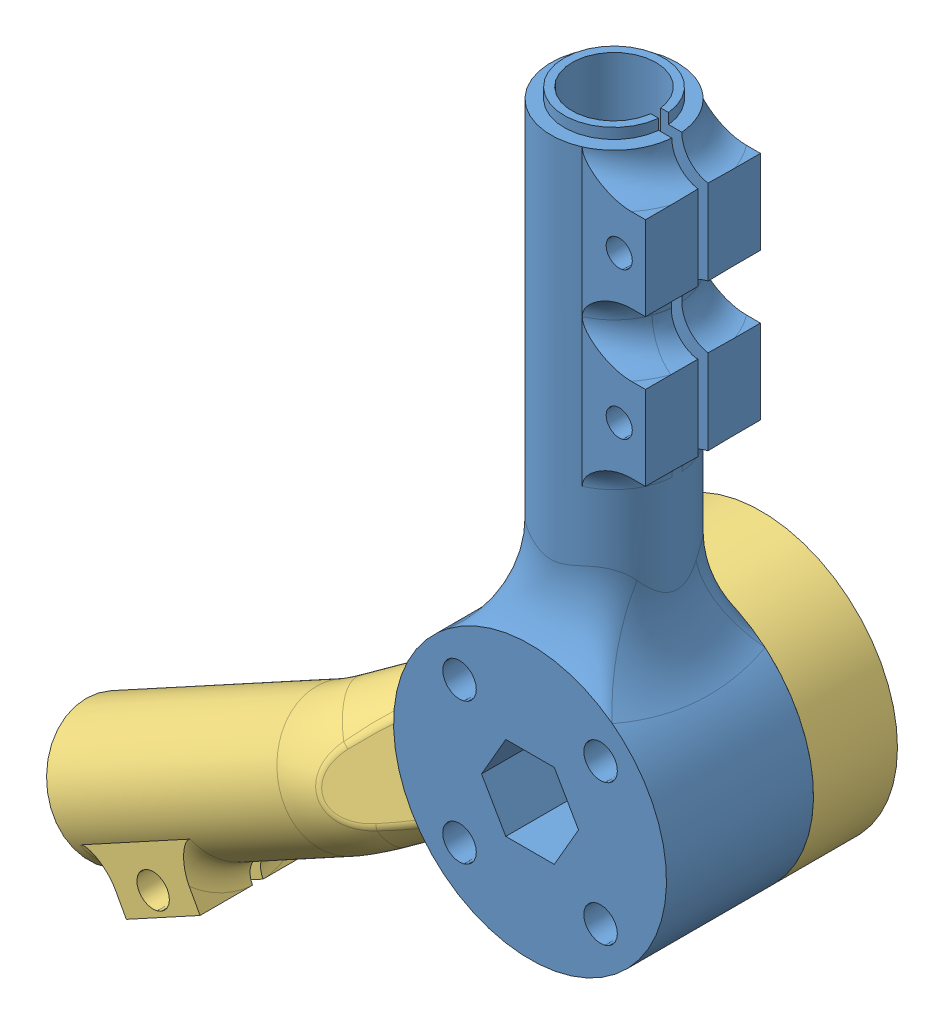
SolidWorks assembly Motor_joint.SLDASM, configuration 默认 (file format 15000). Lengths in mm.
Overall size (72.15 92.75 22).
3 component instances, 3 part files, 7 mates.
Components (placement in the parent):
- Top_joint-1: Top_joint.SLDPRT [默认] at origin size (26 68 14)
- Joint_bearing-1: Joint_bearing.SLDPRT [默认] at (0 0 -3) x (-0.160333 -0.987063 0) z (-0.987063 0.160333 0) size (22 6 22)
- Bottom_joint-1: Bottom_joint.SLDPRT [默认] x (-0.877888 -0.478867 0) z (-0.478867 0.877888 0) size (68 20 26)
Mates (geometry in assembly coordinates):
- 重合1: coincident aligned: plane of 关节上2.0-1 through (0 0 0) normal (0 0 1)
- 重合2: coincident aligned: plane of 关节上2.0-1 through (0 0 0) normal (0 1 0)
- 重合3: coincident aligned: plane of 关节上2.0-1 through (0 0 0) normal (1 0 0)
- 同心1: concentric aligned: cylinder of 关节上2.0-1 through (0 0 -6) axis (0 0 1) radius 11; cylinder of 关节轴承-1 through (0 0 -6) axis (0 0 1) radius 11
- 重合4: coincident anti-aligned: plane of 关节上2.0-1 through (0 0 0) normal (0 0 -1); plane of 关节轴承-1 through (0 0 0) normal (0 0 1)
- 同心5: concentric anti-aligned: cylinder of 关节上2.0-1 through (0 0 8) axis (0 0 -1) radius 13; cylinder of 关节下2.0-1 through (0 0 -14) axis (0 0 1) radius 13
- 重合9: coincident anti-aligned: plane of 关节上2.0-1 through (0 0 -6) normal (0 0 -1); plane of 关节下2.0-1 through (0 0 -6) normal (0 0 1)
